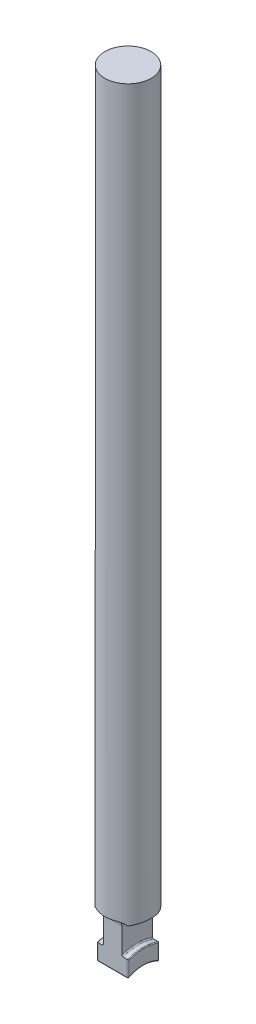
from build123d import *

# Parameters (mm, degrees)
SKETCH1_W               = 15
SKETCH1_H               = 260
BOSS_EXTRUDE1_DEPTH     = 7.5
CUT_EXTRUDE4_DEPTH      = 261.216256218
CUT_EXTRUDE4_DEPTH_BACK = 261.216256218
SKETCH8_R               = 10
SKETCH2_W               = 4.5
SKETCH2_H               = 9.5
CUT_EXTRUDE2_DEPTH      = 261.216256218
CUT_EXTRUDE2_DEPTH_BACK = 261.216256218
CUT_EXTRUDE3_DEPTH      = 261.216256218
CUT_EXTRUDE3_DEPTH_BACK = 261.216256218
SKETCH7_W               = 2.5
SKETCH7_H               = 15
FILLET1_R               = 0.762
FILLET2_R               = 0.381
FILLET3_R               = 0.254
SKETCH9_OUTSIDE_W       = 67.412
SKETCH9_OUTSIDE_H       = 67.412
SKETCH9_OUTSIDE_R       = 7.5
CUT_EXTRUDE5_DEPTH      = 252.388302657


with BuildPart() as part:
    # Sketch1 → Boss-Extrude1 (new, symmetric)
    with BuildSketch(Plane(origin=(0, 0, 0), x_dir=(0, 0, -1), z_dir=(1, 0, 0))):
        with Locations((0, 130)):
            Rectangle(SKETCH1_W, SKETCH1_H)
    extrude(amount=BOSS_EXTRUDE1_DEPTH, both=True)

    # Sketch8 → Cut-Extrude4 (cut, two sides: drawn at the far end of the back side and taken through both)
    with BuildSketch(Plane(origin=(0, 0, 0), x_dir=(0, 0, -1), z_dir=(1, 0, 0)).offset(-CUT_EXTRUDE4_DEPTH_BACK)):
        Circle(SKETCH8_R)
    extrude(amount=CUT_EXTRUDE4_DEPTH + CUT_EXTRUDE4_DEPTH_BACK, mode=Mode.SUBTRACT)

    # Sketch2 → Cut-Revolve1 (revolve, cut)
    with BuildSketch(Plane.XY):
        with Locations((5.25, 19.75)):
            Rectangle(SKETCH2_W, SKETCH2_H)
        with Locations((-5.25, 19.75)):
            Rectangle(SKETCH2_W, SKETCH2_H)
    revolve(axis=Axis((-8.84822894, 0, 0), (1, 0, 0)), mode=Mode.SUBTRACT)

    # Sketch6 → Cut-Extrude2 (cut, two sides: drawn at the far end of the back side and taken through both)
    with BuildSketch(Plane(origin=(0, 0, 0), x_dir=(0, 0, -1), z_dir=(1, 0, 0)).offset(-CUT_EXTRUDE2_DEPTH_BACK)):
        with BuildLine():
            Line((5, 0), (24.05, 0))
            Line((24.05, 0), (24.05, 25))
            Line((24.05, 25), (7.3876, 25))
            ThreePointArc((7.3876, 25), (5.699311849, 24.300688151), (5, 22.6124))
            Line((5, 22.6124), (5, 0))
        make_face()
        with BuildLine():
            Line((-5, 0), (-24.05, 0))
            Line((-24.05, 0), (-24.05, 25))
            Line((-24.05, 25), (-7.3876, 25))
            ThreePointArc((-7.3876, 25), (-5.699311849, 24.300688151), (-5, 22.6124))
            Line((-5, 22.6124), (-5, 0))
        make_face()
    extrude(amount=CUT_EXTRUDE2_DEPTH + CUT_EXTRUDE2_DEPTH_BACK, mode=Mode.SUBTRACT)

    # Sketch7 → Cut-Extrude3 (cut, two sides: drawn at the far end of the back side and taken through both)
    with BuildSketch(Plane.XY.offset(-CUT_EXTRUDE3_DEPTH_BACK)):
        with Locations((-6.25, 7.5)):
            Rectangle(SKETCH7_W, SKETCH7_H)
        with Locations((6.25, 7.5)):
            Rectangle(SKETCH7_W, SKETCH7_H)
    extrude(amount=CUT_EXTRUDE3_DEPTH + CUT_EXTRUDE3_DEPTH_BACK, mode=Mode.SUBTRACT)

    # Fillet1
    fillet1_edges = [part.edges().sort_by_distance(p)[0] for p in [
        (3, 24.5, 0),
        (-3, 24.5, 0),
    ]]
    fillet(fillet1_edges, radius=FILLET1_R)

    # Fillet2
    fillet2_edges = [part.edges().sort_by_distance(p)[0] for p in [
        (3, 15, 0),
        (-3, 15, 0),
    ]]
    fillet(fillet2_edges, radius=FILLET2_R)

    # Fillet3
    fillet3_edges = [part.edges().sort_by_distance(p)[0] for p in [
        (0, 8.660254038, -5),
        (5, 11.401194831, -5),
        (-5, 11.401194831, -5),
        (0, 8.660254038, 5),
        (-5, 15, 0),
        (-5, 11.401194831, 5),
        (-5, 10, 0),
        (5, 15, 0),
        (5, 10, 0),
        (5, 11.401194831, 5),
    ]]
    fillet(fillet3_edges, radius=FILLET3_R)

    # Sketch9 outside → Cut-Extrude5 (cut, through all)
    with BuildSketch(Plane(origin=(0, 260, 0), x_dir=(1, 0, 0), z_dir=(0, 1, 0))):
        Rectangle(SKETCH9_OUTSIDE_W, SKETCH9_OUTSIDE_H)
        with Locations(Location((0, 0, 0), (0, 0, 270))):
            Circle(SKETCH9_OUTSIDE_R, mode=Mode.SUBTRACT)
    extrude(amount=-CUT_EXTRUDE5_DEPTH, mode=Mode.SUBTRACT)


solid = part.part
